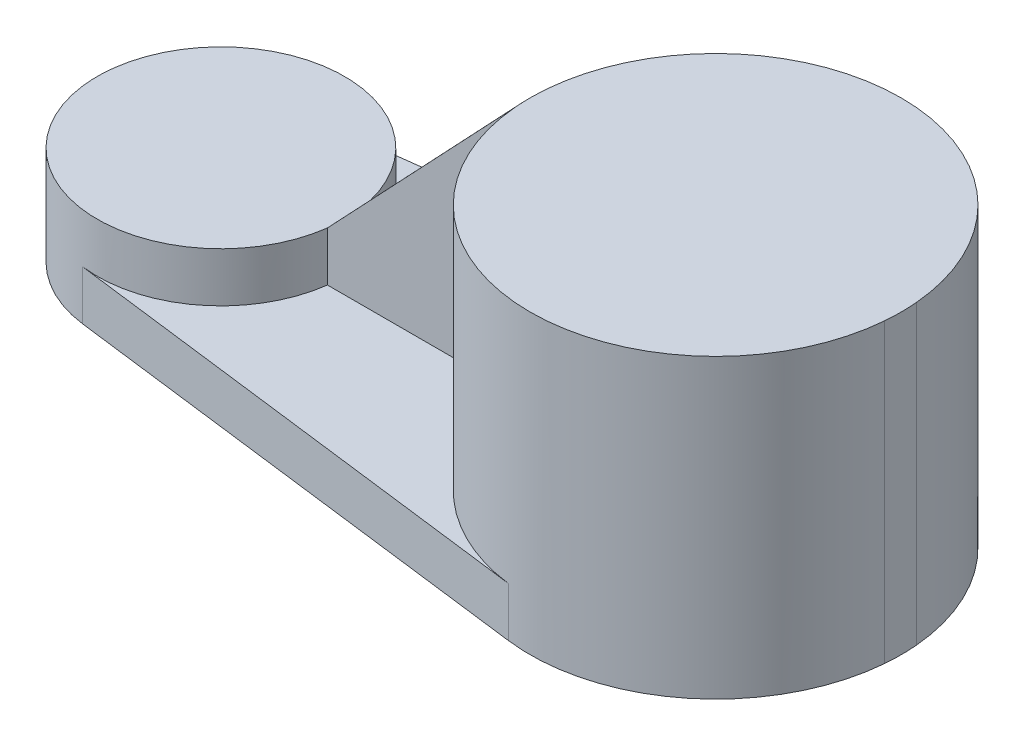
ISO-10303-21;
HEADER;
FILE_DESCRIPTION(('STEP AP214'),'2;1');
FILE_NAME('part.step','',(''),(''),'','','');
FILE_SCHEMA(('AUTOMOTIVE_DESIGN { 1 0 10303 214 1 1 1 1 }'));
ENDSEC;
DATA;
#1=APPLICATION_CONTEXT('core data for automotive mechanical design processes');
#2=APPLICATION_PROTOCOL_DEFINITION('international standard','automotive_design',2000,#1);
#3=PRODUCT_CONTEXT('',#1,'mechanical');
#4=PRODUCT('Part','Part','',(#3));
#5=PRODUCT_RELATED_PRODUCT_CATEGORY('part','',(#4));
#6=PRODUCT_DEFINITION_FORMATION('','',#4);
#7=PRODUCT_DEFINITION_CONTEXT('part definition',#1,'design');
#8=PRODUCT_DEFINITION('design','',#6,#7);
#9=PRODUCT_DEFINITION_SHAPE('','',#8);
#10=(LENGTH_UNIT() NAMED_UNIT(*) SI_UNIT(.MILLI.,.METRE.));
#11=(NAMED_UNIT(*) PLANE_ANGLE_UNIT() SI_UNIT($,.RADIAN.));
#12=(NAMED_UNIT(*) SI_UNIT($,.STERADIAN.) SOLID_ANGLE_UNIT());
#13=UNCERTAINTY_MEASURE_WITH_UNIT(LENGTH_MEASURE(1.E-05),#10,'distance_accuracy_value','');
#14=(GEOMETRIC_REPRESENTATION_CONTEXT(3) GLOBAL_UNCERTAINTY_ASSIGNED_CONTEXT((#13)) GLOBAL_UNIT_ASSIGNED_CONTEXT((#10,
#11,#12)) REPRESENTATION_CONTEXT('',''));
#15=CARTESIAN_POINT('',(0.,0.,0.));
#16=DIRECTION('',(0.,0.,1.));
#17=DIRECTION('',(1.,0.,0.));
#18=AXIS2_PLACEMENT_3D('',#15,#16,#17);
#19=CARTESIAN_POINT('',(100.,10.,0.));
#20=DIRECTION('',(0.,-1.,0.));
#21=DIRECTION('',(0.,0.,-1.));
#22=AXIS2_PLACEMENT_3D('',#19,#20,#21);
#23=PLANE('',#22);
#24=DIRECTION('',(-1.,0.,0.));
#25=VECTOR('',#24,1.);
#26=CARTESIAN_POINT('',(62.6413575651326,10.,-3.25297332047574));
#27=LINE('',#26,#25);
#28=CARTESIAN_POINT('',(62.6413575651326,10.,-3.25297332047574));
#29=VERTEX_POINT('',#28);
#30=CARTESIAN_POINT('',(24.7874598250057,10.,-3.25297332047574));
#31=VERTEX_POINT('',#30);
#32=EDGE_CURVE('E176',#29,#31,#27,.T.);
#33=ORIENTED_EDGE('',*,*,#32,.F.);
#34=CARTESIAN_POINT('',(100.,10.,0.));
#35=DIRECTION('',(0.,1.,0.));
#36=DIRECTION('',(0.,0.,-1.));
#37=AXIS2_PLACEMENT_3D('',#34,#35,#36);
#38=CIRCLE('',#37,37.5);
#39=CARTESIAN_POINT('',(95.3125,10.,-37.2058778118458));
#40=VERTEX_POINT('',#39);
#41=EDGE_CURVE('E159',#40,#29,#38,.T.);
#42=ORIENTED_EDGE('',*,*,#41,.F.);
#43=DIRECTION('',(0.992156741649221,0.,-0.125));
#44=VECTOR('',#43,1.);
#45=CARTESIAN_POINT('',(95.3125,10.,-37.2058778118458));
#46=LINE('',#45,#44);
#47=CARTESIAN_POINT('',(-3.125,10.,-24.8039185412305));
#48=VERTEX_POINT('',#47);
#49=EDGE_CURVE('E205',#48,#40,#46,.T.);
#50=ORIENTED_EDGE('',*,*,#49,.F.);
#51=CARTESIAN_POINT('',(0.,10.,0.));
#52=DIRECTION('',(0.,1.,0.));
#53=DIRECTION('',(0.,0.,-1.));
#54=AXIS2_PLACEMENT_3D('',#51,#52,#53);
#55=CIRCLE('',#54,25.);
#56=EDGE_CURVE('E202',#31,#48,#55,.T.);
#57=ORIENTED_EDGE('',*,*,#56,.F.);
#58=EDGE_LOOP('',(#33,#42,#50,#57));
#59=FACE_BOUND('',#58,.T.);
#60=ADVANCED_FACE('F53',(#59),#23,.F.);
#61=DIRECTION('',(-1.,0.,0.));
#62=VECTOR('',#61,1.);
#63=CARTESIAN_POINT('',(62.6413575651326,10.,3.25297332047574));
#64=LINE('',#63,#62);
#65=CARTESIAN_POINT('',(62.6413575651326,10.,3.25297332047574));
#66=VERTEX_POINT('',#65);
#67=CARTESIAN_POINT('',(24.7874598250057,10.,3.25297332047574));
#68=VERTEX_POINT('',#67);
#69=EDGE_CURVE('E153',#66,#68,#64,.T.);
#70=ORIENTED_EDGE('',*,*,#69,.T.);
#71=CARTESIAN_POINT('',(-3.125,10.,24.8039185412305));
#72=VERTEX_POINT('',#71);
#73=EDGE_CURVE('E203',#72,#68,#55,.T.);
#74=ORIENTED_EDGE('',*,*,#73,.F.);
#75=DIRECTION('',(-0.992156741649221,0.,-0.125));
#76=VECTOR('',#75,1.);
#77=CARTESIAN_POINT('',(95.3125,10.,37.2058778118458));
#78=LINE('',#77,#76);
#79=CARTESIAN_POINT('',(95.3125,10.,37.2058778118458));
#80=VERTEX_POINT('',#79);
#81=EDGE_CURVE('E155',#80,#72,#78,.T.);
#82=ORIENTED_EDGE('',*,*,#81,.F.);
#83=EDGE_CURVE('E148',#66,#80,#38,.T.);
#84=ORIENTED_EDGE('',*,*,#83,.F.);
#85=EDGE_LOOP('',(#70,#74,#82,#84));
#86=FACE_BOUND('',#85,.T.);
#87=ADVANCED_FACE('F150',(#86),#23,.F.);
#88=CARTESIAN_POINT('',(0.,20.,0.));
#89=DIRECTION('',(0.,-1.,0.));
#90=DIRECTION('',(0.,0.,-1.));
#91=AXIS2_PLACEMENT_3D('',#88,#89,#90);
#92=CYLINDRICAL_SURFACE('',#91,25.);
#93=DIRECTION('',(0.,-1.,0.));
#94=VECTOR('',#93,1.);
#95=CARTESIAN_POINT('',(24.7874598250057,20.,3.25297332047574));
#96=LINE('',#95,#94);
#97=CARTESIAN_POINT('',(24.7874598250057,20.,3.25297332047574));
#98=VERTEX_POINT('',#97);
#99=EDGE_CURVE('E12',#98,#68,#96,.T.);
#100=ORIENTED_EDGE('',*,*,#99,.F.);
#101=CARTESIAN_POINT('',(0.,20.,0.));
#102=DIRECTION('',(0.,1.,0.));
#103=DIRECTION('',(0.,0.,1.));
#104=AXIS2_PLACEMENT_3D('',#101,#102,#103);
#105=CIRCLE('',#104,25.);
#106=CARTESIAN_POINT('',(-24.7874598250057,20.,3.25297332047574));
#107=VERTEX_POINT('',#106);
#108=EDGE_CURVE('E223',#107,#98,#105,.T.);
#109=ORIENTED_EDGE('',*,*,#108,.F.);
#110=DIRECTION('',(0.,-1.,0.));
#111=VECTOR('',#110,1.);
#112=CARTESIAN_POINT('',(-24.7874598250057,20.,3.25297332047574));
#113=LINE('',#112,#111);
#114=CARTESIAN_POINT('',(-24.7874598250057,0.,3.25297332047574));
#115=VERTEX_POINT('',#114);
#116=EDGE_CURVE('E68',#115,#107,#113,.F.);
#117=ORIENTED_EDGE('',*,*,#116,.F.);
#118=CARTESIAN_POINT('',(0.,0.,0.));
#119=DIRECTION('',(0.,1.,0.));
#120=DIRECTION('',(0.,0.,1.));
#121=AXIS2_PLACEMENT_3D('',#118,#119,#120);
#122=CIRCLE('',#121,25.);
#123=CARTESIAN_POINT('',(-3.125,0.,24.8039185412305));
#124=VERTEX_POINT('',#123);
#125=EDGE_CURVE('E212',#115,#124,#122,.T.);
#126=ORIENTED_EDGE('',*,*,#125,.T.);
#127=DIRECTION('',(0.,-1.,0.));
#128=VECTOR('',#127,1.);
#129=CARTESIAN_POINT('',(-3.125,10.,24.8039185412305));
#130=LINE('',#129,#128);
#131=EDGE_CURVE('E216',#72,#124,#130,.T.);
#132=ORIENTED_EDGE('',*,*,#131,.F.);
#133=ORIENTED_EDGE('',*,*,#73,.T.);
#134=EDGE_LOOP('',(#100,#109,#117,#126,#132,#133));
#135=FACE_BOUND('',#134,.T.);
#136=ADVANCED_FACE('F280',(#135),#92,.T.);
#137=DIRECTION('',(0.,-1.,0.));
#138=VECTOR('',#137,1.);
#139=CARTESIAN_POINT('',(-24.7874598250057,20.,-3.25297332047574));
#140=LINE('',#139,#138);
#141=CARTESIAN_POINT('',(-24.7874598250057,20.,-3.25297332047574));
#142=VERTEX_POINT('',#141);
#143=CARTESIAN_POINT('',(-24.7874598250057,0.,-3.25297332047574));
#144=VERTEX_POINT('',#143);
#145=EDGE_CURVE('E235',#142,#144,#140,.T.);
#146=ORIENTED_EDGE('',*,*,#145,.F.);
#147=CARTESIAN_POINT('',(24.7874598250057,20.,-3.25297332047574));
#148=VERTEX_POINT('',#147);
#149=EDGE_CURVE('E228',#148,#142,#105,.T.);
#150=ORIENTED_EDGE('',*,*,#149,.F.);
#151=DIRECTION('',(0.,-1.,0.));
#152=VECTOR('',#151,1.);
#153=CARTESIAN_POINT('',(24.7874598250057,20.,-3.25297332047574));
#154=LINE('',#153,#152);
#155=EDGE_CURVE('E172',#31,#148,#154,.F.);
#156=ORIENTED_EDGE('',*,*,#155,.F.);
#157=ORIENTED_EDGE('',*,*,#56,.T.);
#158=DIRECTION('',(0.,-1.,0.));
#159=VECTOR('',#158,1.);
#160=CARTESIAN_POINT('',(-3.12500000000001,10.,-24.8039185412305));
#161=LINE('',#160,#159);
#162=CARTESIAN_POINT('',(-3.12500000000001,0.,-24.8039185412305));
#163=VERTEX_POINT('',#162);
#164=EDGE_CURVE('E213',#48,#163,#161,.T.);
#165=ORIENTED_EDGE('',*,*,#164,.T.);
#166=EDGE_CURVE('E220',#163,#144,#122,.T.);
#167=ORIENTED_EDGE('',*,*,#166,.T.);
#168=EDGE_LOOP('',(#146,#150,#156,#157,#165,#167));
#169=FACE_BOUND('',#168,.T.);
#170=ADVANCED_FACE('F300',(#169),#92,.T.);
#171=CARTESIAN_POINT('',(100.,60.,0.));
#172=DIRECTION('',(0.,-1.,0.));
#173=DIRECTION('',(0.,0.,-1.));
#174=AXIS2_PLACEMENT_3D('',#171,#172,#173);
#175=CYLINDRICAL_SURFACE('',#174,37.5);
#176=DIRECTION('',(0.,-1.,0.));
#177=VECTOR('',#176,1.);
#178=CARTESIAN_POINT('',(137.358642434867,60.,3.25297332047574));
#179=LINE('',#178,#177);
#180=CARTESIAN_POINT('',(137.358642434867,0.,3.25297332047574));
#181=VERTEX_POINT('',#180);
#182=CARTESIAN_POINT('',(137.358642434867,60.,3.25297332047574));
#183=VERTEX_POINT('',#182);
#184=EDGE_CURVE('E173',#181,#183,#179,.F.);
#185=ORIENTED_EDGE('',*,*,#184,.F.);
#186=CARTESIAN_POINT('',(100.,0.,0.));
#187=DIRECTION('',(0.,1.,0.));
#188=DIRECTION('',(0.,0.,1.));
#189=AXIS2_PLACEMENT_3D('',#186,#187,#188);
#190=CIRCLE('',#189,37.5);
#191=CARTESIAN_POINT('',(137.358642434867,0.,-3.25297332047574));
#192=VERTEX_POINT('',#191);
#193=EDGE_CURVE('E190',#181,#192,#190,.T.);
#194=ORIENTED_EDGE('',*,*,#193,.T.);
#195=DIRECTION('',(0.,-1.,0.));
#196=VECTOR('',#195,1.);
#197=CARTESIAN_POINT('',(137.358642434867,60.,-3.25297332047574));
#198=LINE('',#197,#196);
#199=CARTESIAN_POINT('',(137.358642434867,60.,-3.25297332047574));
#200=VERTEX_POINT('',#199);
#201=EDGE_CURVE('E229',#200,#192,#198,.T.);
#202=ORIENTED_EDGE('',*,*,#201,.F.);
#203=CARTESIAN_POINT('',(100.,60.,0.));
#204=DIRECTION('',(0.,1.,0.));
#205=DIRECTION('',(0.,0.,1.));
#206=AXIS2_PLACEMENT_3D('',#203,#204,#205);
#207=CIRCLE('',#206,37.5);
#208=EDGE_CURVE('E191',#183,#200,#207,.T.);
#209=ORIENTED_EDGE('',*,*,#208,.F.);
#210=EDGE_LOOP('',(#185,#194,#202,#209));
#211=FACE_BOUND('',#210,.T.);
#212=ADVANCED_FACE('F323',(#211),#175,.T.);
#213=CARTESIAN_POINT('',(62.6413575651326,60.,3.25297332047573));
#214=VERTEX_POINT('',#213);
#215=EDGE_CURVE('E166',#214,#183,#207,.T.);
#216=ORIENTED_EDGE('',*,*,#215,.F.);
#217=DIRECTION('',(0.,-1.,0.));
#218=VECTOR('',#217,1.);
#219=CARTESIAN_POINT('',(62.6413575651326,60.,3.25297332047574));
#220=LINE('',#219,#218);
#221=EDGE_CURVE('E163',#214,#66,#220,.T.);
#222=ORIENTED_EDGE('',*,*,#221,.T.);
#223=ORIENTED_EDGE('',*,*,#83,.T.);
#224=DIRECTION('',(0.,-1.,0.));
#225=VECTOR('',#224,1.);
#226=CARTESIAN_POINT('',(95.3125,10.,37.2058778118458));
#227=LINE('',#226,#225);
#228=CARTESIAN_POINT('',(95.3125,0.,37.2058778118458));
#229=VERTEX_POINT('',#228);
#230=EDGE_CURVE('E208',#80,#229,#227,.T.);
#231=ORIENTED_EDGE('',*,*,#230,.T.);
#232=EDGE_CURVE('E187',#229,#181,#190,.T.);
#233=ORIENTED_EDGE('',*,*,#232,.T.);
#234=ORIENTED_EDGE('',*,*,#184,.T.);
#235=EDGE_LOOP('',(#216,#222,#223,#231,#233,#234));
#236=FACE_BOUND('',#235,.T.);
#237=ADVANCED_FACE('F164',(#236),#175,.T.);
#238=EDGE_CURVE('E224',#144,#115,#122,.T.);
#239=ORIENTED_EDGE('',*,*,#238,.T.);
#240=ORIENTED_EDGE('',*,*,#116,.T.);
#241=EDGE_CURVE('E225',#142,#107,#105,.T.);
#242=ORIENTED_EDGE('',*,*,#241,.F.);
#243=ORIENTED_EDGE('',*,*,#145,.T.);
#244=EDGE_LOOP('',(#239,#240,#242,#243));
#245=FACE_BOUND('',#244,.T.);
#246=ADVANCED_FACE('F55',(#245),#92,.T.);
#247=CARTESIAN_POINT('',(-83.0995613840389,20.,0.));
#248=DIRECTION('',(0.,1.,0.));
#249=DIRECTION('',(0.,0.,1.));
#250=AXIS2_PLACEMENT_3D('',#247,#248,#249);
#251=PLANE('',#250);
#252=CARTESIAN_POINT('',(24.7874598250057,20.,3.25297332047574));
#253=CARTESIAN_POINT('',(24.8233571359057,20.,2.97940999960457));
#254=CARTESIAN_POINT('',(24.8546553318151,20.,2.70524764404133));
#255=CARTESIAN_POINT('',(24.9081043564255,20.,2.15605329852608));
#256=CARTESIAN_POINT('',(24.9302558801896,20.,1.88102137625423));
#257=CARTESIAN_POINT('',(24.9654675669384,20.,1.33037929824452));
#258=CARTESIAN_POINT('',(24.9785278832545,20.,1.05476915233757));
#259=CARTESIAN_POINT('',(24.9955841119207,20.,0.503259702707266));
#260=CARTESIAN_POINT('',(24.9995793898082,20.,0.227360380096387));
#261=CARTESIAN_POINT('',(24.9980220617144,20.,-0.583974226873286));
#262=CARTESIAN_POINT('',(24.9799543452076,20.,-1.11943862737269));
#263=CARTESIAN_POINT('',(24.9095112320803,20.,-2.1883625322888));
#264=CARTESIAN_POINT('',(24.8571192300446,20.,-2.72182094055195));
#265=CARTESIAN_POINT('',(24.7874598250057,20.,-3.25297332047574));
#266=B_SPLINE_CURVE_WITH_KNOTS('',3,(#252,#253,#254,#255,#256,#257,#258,#259,#260,#261,#262,
#263,#264,#265),.UNSPECIFIED.,.F.,.F.,(4,2,2,2,2,2,4),(0.,0.827679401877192,1.65529589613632,
2.4828984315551,3.31055888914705,4.91669908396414,6.52361687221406),.UNSPECIFIED.);
#267=EDGE_CURVE('E57',#98,#148,#266,.T.);
#268=ORIENTED_EDGE('',*,*,#267,.T.);
#269=ORIENTED_EDGE('',*,*,#149,.T.);
#270=ORIENTED_EDGE('',*,*,#241,.T.);
#271=ORIENTED_EDGE('',*,*,#108,.T.);
#272=EDGE_LOOP('',(#268,#269,#270,#271));
#273=FACE_BOUND('',#272,.T.);
#274=ADVANCED_FACE('F292',(#273),#251,.T.);
#275=CARTESIAN_POINT('',(-83.0995613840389,0.,0.));
#276=DIRECTION('',(0.,1.,0.));
#277=DIRECTION('',(0.,0.,1.));
#278=AXIS2_PLACEMENT_3D('',#275,#276,#277);
#279=PLANE('',#278);
#280=ORIENTED_EDGE('',*,*,#166,.F.);
#281=DIRECTION('',(0.992156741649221,0.,-0.125));
#282=VECTOR('',#281,1.);
#283=CARTESIAN_POINT('',(95.3125,0.,-37.2058778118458));
#284=LINE('',#283,#282);
#285=CARTESIAN_POINT('',(95.3125,0.,-37.2058778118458));
#286=VERTEX_POINT('',#285);
#287=EDGE_CURVE('E160',#163,#286,#284,.T.);
#288=ORIENTED_EDGE('',*,*,#287,.T.);
#289=EDGE_CURVE('E186',#192,#286,#190,.T.);
#290=ORIENTED_EDGE('',*,*,#289,.F.);
#291=ORIENTED_EDGE('',*,*,#193,.F.);
#292=ORIENTED_EDGE('',*,*,#232,.F.);
#293=DIRECTION('',(-0.992156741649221,0.,-0.125));
#294=VECTOR('',#293,1.);
#295=CARTESIAN_POINT('',(95.3125,0.,37.2058778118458));
#296=LINE('',#295,#294);
#297=EDGE_CURVE('E194',#229,#124,#296,.T.);
#298=ORIENTED_EDGE('',*,*,#297,.T.);
#299=ORIENTED_EDGE('',*,*,#125,.F.);
#300=ORIENTED_EDGE('',*,*,#238,.F.);
#301=EDGE_LOOP('',(#280,#288,#290,#291,#292,#298,#299,#300));
#302=FACE_BOUND('',#301,.T.);
#303=ADVANCED_FACE('F286',(#302),#279,.F.);
#304=CARTESIAN_POINT('',(95.3125,10.,-37.2058778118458));
#305=DIRECTION('',(-0.125,0.,-0.992156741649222));
#306=DIRECTION('',(-0.992156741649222,0.,0.125));
#307=AXIS2_PLACEMENT_3D('',#304,#305,#306);
#308=PLANE('',#307);
#309=ORIENTED_EDGE('',*,*,#287,.F.);
#310=ORIENTED_EDGE('',*,*,#164,.F.);
#311=ORIENTED_EDGE('',*,*,#49,.T.);
#312=DIRECTION('',(0.,-1.,0.));
#313=VECTOR('',#312,1.);
#314=CARTESIAN_POINT('',(95.3125,10.,-37.2058778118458));
#315=LINE('',#314,#313);
#316=EDGE_CURVE('E209',#40,#286,#315,.T.);
#317=ORIENTED_EDGE('',*,*,#316,.T.);
#318=EDGE_LOOP('',(#309,#310,#311,#317));
#319=FACE_BOUND('',#318,.T.);
#320=ADVANCED_FACE('F282',(#319),#308,.T.);
#321=CARTESIAN_POINT('',(95.3125,10.,37.2058778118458));
#322=DIRECTION('',(-0.125,0.,0.992156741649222));
#323=DIRECTION('',(0.992156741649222,0.,0.125));
#324=AXIS2_PLACEMENT_3D('',#321,#322,#323);
#325=PLANE('',#324);
#326=ORIENTED_EDGE('',*,*,#297,.F.);
#327=ORIENTED_EDGE('',*,*,#230,.F.);
#328=ORIENTED_EDGE('',*,*,#81,.T.);
#329=ORIENTED_EDGE('',*,*,#131,.T.);
#330=EDGE_LOOP('',(#326,#327,#328,#329));
#331=FACE_BOUND('',#330,.T.);
#332=ADVANCED_FACE('F285',(#331),#325,.T.);
#333=CARTESIAN_POINT('',(62.6413575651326,60.,-3.25297332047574));
#334=VERTEX_POINT('',#333);
#335=EDGE_CURVE('E195',#200,#334,#207,.T.);
#336=ORIENTED_EDGE('',*,*,#335,.F.);
#337=ORIENTED_EDGE('',*,*,#201,.T.);
#338=ORIENTED_EDGE('',*,*,#289,.T.);
#339=ORIENTED_EDGE('',*,*,#316,.F.);
#340=ORIENTED_EDGE('',*,*,#41,.T.);
#341=DIRECTION('',(0.,-1.,0.));
#342=VECTOR('',#341,1.);
#343=CARTESIAN_POINT('',(62.6413575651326,60.,-3.25297332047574));
#344=LINE('',#343,#342);
#345=EDGE_CURVE('E232',#29,#334,#344,.F.);
#346=ORIENTED_EDGE('',*,*,#345,.T.);
#347=EDGE_LOOP('',(#336,#337,#338,#339,#340,#346));
#348=FACE_BOUND('',#347,.T.);
#349=ADVANCED_FACE('F272',(#348),#175,.T.);
#350=CARTESIAN_POINT('',(-83.0995613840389,60.,0.));
#351=DIRECTION('',(0.,1.,0.));
#352=DIRECTION('',(0.,0.,1.));
#353=AXIS2_PLACEMENT_3D('',#350,#351,#352);
#354=PLANE('',#353);
#355=ORIENTED_EDGE('',*,*,#208,.T.);
#356=ORIENTED_EDGE('',*,*,#335,.T.);
#357=CARTESIAN_POINT('',(62.6413575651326,60.,-3.25297332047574));
#358=CARTESIAN_POINT('',(62.5935276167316,60.,-2.70348796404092));
#359=CARTESIAN_POINT('',(62.5578806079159,60.,-2.15294670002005));
#360=CARTESIAN_POINT('',(62.5108849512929,60.,-1.05082900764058));
#361=CARTESIAN_POINT('',(62.4995362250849,60.,-0.499252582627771));
#362=CARTESIAN_POINT('',(62.5010450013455,60.,0.58637291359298));
#363=CARTESIAN_POINT('',(62.5131463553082,60.,1.12042316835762));
#364=CARTESIAN_POINT('',(62.5601378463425,60.,2.18763577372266));
#365=CARTESIAN_POINT('',(62.5950329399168,60.,2.72079790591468));
#366=CARTESIAN_POINT('',(62.6413575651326,60.,3.25297332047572));
#367=B_SPLINE_CURVE_WITH_KNOTS('',3,(#357,#358,#359,#360,#361,#362,#363,#364,#365,#366),
.UNSPECIFIED.,.F.,.F.,(4,2,2,2,4),(0.,1.65454820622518,3.30909107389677,4.91116976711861,
6.51359694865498),.UNSPECIFIED.);
#368=EDGE_CURVE('E244',#334,#214,#367,.T.);
#369=ORIENTED_EDGE('',*,*,#368,.T.);
#370=ORIENTED_EDGE('',*,*,#215,.T.);
#371=EDGE_LOOP('',(#355,#356,#369,#370));
#372=FACE_BOUND('',#371,.T.);
#373=ADVANCED_FACE('F249',(#372),#354,.T.);
#374=CARTESIAN_POINT('',(24.7874598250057,10.,-3.25297332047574));
#375=DIRECTION('',(0.,0.,-1.));
#376=DIRECTION('',(-1.,0.,0.));
#377=AXIS2_PLACEMENT_3D('',#374,#375,#376);
#378=PLANE('',#377);
#379=ORIENTED_EDGE('',*,*,#32,.T.);
#380=ORIENTED_EDGE('',*,*,#155,.T.);
#381=DIRECTION('',(-0.687353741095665,-0.726322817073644,0.));
#382=VECTOR('',#381,1.);
#383=CARTESIAN_POINT('',(62.6413575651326,60.,-3.25297332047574));
#384=LINE('',#383,#382);
#385=EDGE_CURVE('E180',#334,#148,#384,.T.);
#386=ORIENTED_EDGE('',*,*,#385,.F.);
#387=ORIENTED_EDGE('',*,*,#345,.F.);
#388=EDGE_LOOP('',(#379,#380,#386,#387));
#389=FACE_BOUND('',#388,.T.);
#390=ADVANCED_FACE('F259',(#389),#378,.T.);
#391=CARTESIAN_POINT('',(62.6413575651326,60.,3.25297332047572));
#392=CARTESIAN_POINT('',(24.7874598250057,20.,3.25297332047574));
#393=CARTESIAN_POINT('',(62.4532360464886,60.,1.09249923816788));
#394=CARTESIAN_POINT('',(25.0696421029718,20.,1.10276144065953));
#395=CARTESIAN_POINT('',(62.4532360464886,60.,-1.0924992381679));
#396=CARTESIAN_POINT('',(25.0696421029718,20.,-1.10276144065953));
#397=CARTESIAN_POINT('',(62.6413575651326,60.,-3.25297332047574));
#398=CARTESIAN_POINT('',(24.7874598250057,20.,-3.25297332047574));
#399=B_SPLINE_SURFACE_WITH_KNOTS('',3,1,((#391,#392),(#393,#394),(#395,#396),(#397,#398)),
.UNSPECIFIED.,.F.,.F.,.F.,(4,4),(2,2),(0.,1.),(0.,1.),.UNSPECIFIED.);
#400=DIRECTION('',(-0.687353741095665,-0.726322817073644,0.));
#401=VECTOR('',#400,1.);
#402=CARTESIAN_POINT('',(62.6413575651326,60.,3.25297332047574));
#403=LINE('',#402,#401);
#404=EDGE_CURVE('E177',#214,#98,#403,.T.);
#405=ORIENTED_EDGE('',*,*,#368,.F.);
#406=ORIENTED_EDGE('',*,*,#385,.T.);
#407=ORIENTED_EDGE('',*,*,#267,.F.);
#408=ORIENTED_EDGE('',*,*,#404,.F.);
#409=EDGE_LOOP('',(#405,#406,#407,#408));
#410=FACE_BOUND('',#409,.T.);
#411=ADVANCED_FACE('F253',(#410),#399,.T.);
#412=CARTESIAN_POINT('',(15.323985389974,10.,3.25297332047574));
#413=DIRECTION('',(0.,0.,-1.));
#414=DIRECTION('',(-1.,0.,0.));
#415=AXIS2_PLACEMENT_3D('',#412,#413,#414);
#416=PLANE('',#415);
#417=ORIENTED_EDGE('',*,*,#404,.T.);
#418=ORIENTED_EDGE('',*,*,#99,.T.);
#419=ORIENTED_EDGE('',*,*,#69,.F.);
#420=ORIENTED_EDGE('',*,*,#221,.F.);
#421=EDGE_LOOP('',(#417,#418,#419,#420));
#422=FACE_BOUND('',#421,.T.);
#423=ADVANCED_FACE('F175',(#422),#416,.F.);
#424=CLOSED_SHELL('',(#60,#87,#136,#170,#212,#237,#246,#274,#303,#320,#332,#349,#373,#390,#411,#423));
#425=MANIFOLD_SOLID_BREP('B2',#424);
#426=ADVANCED_BREP_SHAPE_REPRESENTATION('',(#18,#425),#14);
#427=SHAPE_DEFINITION_REPRESENTATION(#9,#426);
ENDSEC;
END-ISO-10303-21;
